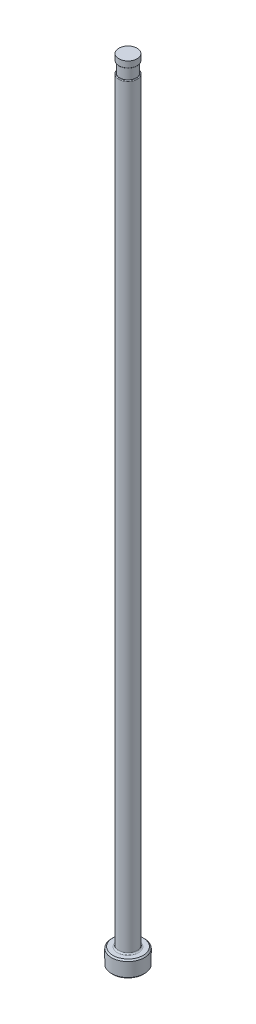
ISO-10303-21;
HEADER;
FILE_DESCRIPTION(('STEP AP214'),'2;1');
FILE_NAME('part.step','',(''),(''),'','','');
FILE_SCHEMA(('AUTOMOTIVE_DESIGN { 1 0 10303 214 1 1 1 1 }'));
ENDSEC;
DATA;
#1=APPLICATION_CONTEXT('core data for automotive mechanical design processes');
#2=APPLICATION_PROTOCOL_DEFINITION('international standard','automotive_design',2000,#1);
#3=PRODUCT_CONTEXT('',#1,'mechanical');
#4=PRODUCT('Part','Part','',(#3));
#5=PRODUCT_RELATED_PRODUCT_CATEGORY('part','',(#4));
#6=PRODUCT_DEFINITION_FORMATION('','',#4);
#7=PRODUCT_DEFINITION_CONTEXT('part definition',#1,'design');
#8=PRODUCT_DEFINITION('design','',#6,#7);
#9=PRODUCT_DEFINITION_SHAPE('','',#8);
#10=(LENGTH_UNIT() NAMED_UNIT(*) SI_UNIT(.MILLI.,.METRE.));
#11=(NAMED_UNIT(*) PLANE_ANGLE_UNIT() SI_UNIT($,.RADIAN.));
#12=(NAMED_UNIT(*) SI_UNIT($,.STERADIAN.) SOLID_ANGLE_UNIT());
#13=UNCERTAINTY_MEASURE_WITH_UNIT(LENGTH_MEASURE(1.E-05),#10,'distance_accuracy_value','');
#14=(GEOMETRIC_REPRESENTATION_CONTEXT(3) GLOBAL_UNCERTAINTY_ASSIGNED_CONTEXT((#13)) GLOBAL_UNIT_ASSIGNED_CONTEXT((#10,
#11,#12)) REPRESENTATION_CONTEXT('',''));
#15=CARTESIAN_POINT('',(0.,0.,0.));
#16=DIRECTION('',(0.,0.,1.));
#17=DIRECTION('',(1.,0.,0.));
#18=AXIS2_PLACEMENT_3D('',#15,#16,#17);
#19=CARTESIAN_POINT('',(-1.78561999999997,151.13,0.));
#20=DIRECTION('',(0.,1.,0.));
#21=DIRECTION('',(0.,0.,1.));
#22=AXIS2_PLACEMENT_3D('',#19,#20,#21);
#23=PLANE('',#22);
#24=CARTESIAN_POINT('',(0.,151.13,0.));
#25=DIRECTION('',(0.,1.,0.));
#26=DIRECTION('',(0.,0.,1.));
#27=AXIS2_PLACEMENT_3D('',#24,#25,#26);
#28=CIRCLE('',#27,1.63956999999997);
#29=CARTESIAN_POINT('',(0.,151.13,1.63956999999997));
#30=VERTEX_POINT('',#29);
#31=EDGE_CURVE('E11',#30,#30,#28,.F.);
#32=ORIENTED_EDGE('',*,*,#31,.T.);
#33=EDGE_LOOP('',(#32));
#34=FACE_BOUND('',#33,.T.);
#35=CARTESIAN_POINT('',(0.,151.13,0.));
#36=DIRECTION('',(0.,1.,0.));
#37=DIRECTION('',(0.,0.,1.));
#38=AXIS2_PLACEMENT_3D('',#35,#36,#37);
#39=CIRCLE('',#38,1.58241999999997);
#40=CARTESIAN_POINT('',(0.,151.13,1.58241999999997));
#41=VERTEX_POINT('',#40);
#42=EDGE_CURVE('E78',#41,#41,#39,.T.);
#43=ORIENTED_EDGE('',*,*,#42,.T.);
#44=EDGE_LOOP('',(#43));
#45=FACE_BOUND('',#44,.T.);
#46=ADVANCED_FACE('F36',(#34,#45),#23,.F.);
#47=CARTESIAN_POINT('',(0.,259.958771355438,0.));
#48=DIRECTION('',(0.,1.,0.));
#49=DIRECTION('',(0.,0.,1.));
#50=AXIS2_PLACEMENT_3D('',#47,#48,#49);
#51=CYLINDRICAL_SURFACE('',#50,1.78561999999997);
#52=DIRECTION('',(0.,1.,0.));
#53=VECTOR('',#52,1.);
#54=CARTESIAN_POINT('',(-1.58241999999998,259.958771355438,-0.827276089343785));
#55=LINE('',#54,#53);
#56=CARTESIAN_POINT('',(-1.58241999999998,148.971,-0.827276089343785));
#57=VERTEX_POINT('',#56);
#58=CARTESIAN_POINT('',(-1.58241999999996,86.614,-0.827276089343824));
#59=VERTEX_POINT('',#58);
#60=EDGE_CURVE('E73',#57,#59,#55,.F.);
#61=ORIENTED_EDGE('',*,*,#60,.F.);
#62=CARTESIAN_POINT('',(0.,148.971,0.));
#63=DIRECTION('',(0.,-1.,0.));
#64=DIRECTION('',(0.,0.,-1.));
#65=AXIS2_PLACEMENT_3D('',#62,#63,#64);
#66=CIRCLE('',#65,1.78561999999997);
#67=CARTESIAN_POINT('',(-1.58241999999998,148.971,0.827276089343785));
#68=VERTEX_POINT('',#67);
#69=EDGE_CURVE('E51',#57,#68,#66,.T.);
#70=ORIENTED_EDGE('',*,*,#69,.T.);
#71=DIRECTION('',(0.,1.,0.));
#72=VECTOR('',#71,1.);
#73=CARTESIAN_POINT('',(-1.58241999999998,259.958771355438,0.827276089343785));
#74=LINE('',#73,#72);
#75=CARTESIAN_POINT('',(-1.58241999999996,86.614,0.827276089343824));
#76=VERTEX_POINT('',#75);
#77=EDGE_CURVE('E84',#76,#68,#74,.T.);
#78=ORIENTED_EDGE('',*,*,#77,.F.);
#79=CARTESIAN_POINT('',(-1.58241999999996,86.614,-0.827276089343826));
#80=CARTESIAN_POINT('',(-1.58241859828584,86.57930589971,-0.827270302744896));
#81=CARTESIAN_POINT('',(-1.58298930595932,86.5446242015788,-0.826188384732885));
#82=CARTESIAN_POINT('',(-1.58525672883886,86.4754213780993,-0.821832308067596));
#83=CARTESIAN_POINT('',(-1.58695392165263,86.4409003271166,-0.81855721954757));
#84=CARTESIAN_POINT('',(-1.59374670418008,86.3372224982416,-0.805306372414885));
#85=CARTESIAN_POINT('',(-1.60054304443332,86.2685662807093,-0.791903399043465));
#86=CARTESIAN_POINT('',(-1.6181445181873,86.1342279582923,-0.755289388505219));
#87=CARTESIAN_POINT('',(-1.62896089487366,86.0685547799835,-0.732050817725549));
#88=CARTESIAN_POINT('',(-1.65351348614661,85.9428437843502,-0.674760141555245));
#89=CARTESIAN_POINT('',(-1.66723753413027,85.8827839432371,-0.640752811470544));
#90=CARTESIAN_POINT('',(-1.69108481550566,85.7895410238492,-0.574000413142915));
#91=CARTESIAN_POINT('',(-1.70092185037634,85.7539825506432,-0.544463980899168));
#92=CARTESIAN_POINT('',(-1.72024188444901,85.6880696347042,-0.479935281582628));
#93=CARTESIAN_POINT('',(-1.72972525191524,85.6577096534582,-0.444948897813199));
#94=CARTESIAN_POINT('',(-1.74591517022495,85.6079989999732,-0.375854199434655));
#95=CARTESIAN_POINT('',(-1.75282315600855,85.5876636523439,-0.34250427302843));
#96=CARTESIAN_POINT('',(-1.76503091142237,85.552596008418,-0.272685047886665));
#97=CARTESIAN_POINT('',(-1.7703313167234,85.5378614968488,-0.236216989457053));
#98=CARTESIAN_POINT('',(-1.77876737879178,85.5147234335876,-0.160839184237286));
#99=CARTESIAN_POINT('',(-1.78189089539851,85.5063553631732,-0.121917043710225));
#100=CARTESIAN_POINT('',(-1.78553515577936,85.4966126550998,-0.0430875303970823));
#101=CARTESIAN_POINT('',(-1.78605699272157,85.4952350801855,-0.00318057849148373));
#102=CARTESIAN_POINT('',(-1.78451570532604,85.499340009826,0.0723170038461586));
#103=CARTESIAN_POINT('',(-1.78269870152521,85.5041692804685,0.107950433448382));
#104=CARTESIAN_POINT('',(-1.77708661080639,85.5193299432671,0.177853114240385));
#105=CARTESIAN_POINT('',(-1.7732916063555,85.5296611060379,0.212122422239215));
#106=CARTESIAN_POINT('',(-1.76403207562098,85.5554906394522,0.278893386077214));
#107=CARTESIAN_POINT('',(-1.75854739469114,85.5710516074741,0.31136779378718));
#108=CARTESIAN_POINT('',(-1.74640529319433,85.6066424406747,0.373513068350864));
#109=CARTESIAN_POINT('',(-1.73974732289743,85.6266744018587,0.403182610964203));
#110=CARTESIAN_POINT('',(-1.72309018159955,85.6788692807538,0.470106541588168));
#111=CARTESIAN_POINT('',(-1.7127837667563,85.7127475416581,0.50595017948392));
#112=CARTESIAN_POINT('',(-1.69205421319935,85.7859822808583,0.57146965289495));
#113=CARTESIAN_POINT('',(-1.68163090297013,85.8253481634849,0.601134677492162));
#114=CARTESIAN_POINT('',(-1.65852628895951,85.9207765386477,0.662663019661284));
#115=CARTESIAN_POINT('',(-1.64612995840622,85.9782622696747,0.692421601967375));
#116=CARTESIAN_POINT('',(-1.62408795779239,86.0976981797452,0.742649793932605));
#117=CARTESIAN_POINT('',(-1.61444888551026,86.1596586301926,0.763097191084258));
#118=CARTESIAN_POINT('',(-1.5986900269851,86.2866358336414,0.795586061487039));
#119=CARTESIAN_POINT('',(-1.59259533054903,86.3516709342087,0.807567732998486));
#120=CARTESIAN_POINT('',(-1.58649588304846,86.4498700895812,0.819442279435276));
#121=CARTESIAN_POINT('',(-1.58496990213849,86.4826111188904,0.822384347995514));
#122=CARTESIAN_POINT('',(-1.58293155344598,86.5482312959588,0.826298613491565));
#123=CARTESIAN_POINT('',(-1.58241884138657,86.5811103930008,0.827271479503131));
#124=CARTESIAN_POINT('',(-1.58241999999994,86.6139999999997,0.827276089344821));
#125=B_SPLINE_CURVE_WITH_KNOTS('',3,(#79,#80,#81,#82,#83,#84,#85,#86,#87,#88,#89,#90,#91,#92,
#93,#94,#95,#96,#97,#98,#99,#100,#101,#102,#103,#104,#105,#106,#107,#108,#109,#110,#111,#112,
#113,#114,#115,#116,#117,#118,#119,#120,#121,#122,#123,#124),.UNSPECIFIED.,.F.,.F.,(4,2,2,2,2,2,
2,2,2,2,2,2,2,2,2,2,2,2,2,2,2,2,4),(0.,0.104035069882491,0.208114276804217,0.418101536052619,
0.628680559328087,0.838395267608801,0.979683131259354,1.12081951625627,1.23932997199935,
1.35779350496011,1.47691251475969,1.59598146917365,1.70348686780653,1.81098778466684,
1.91982417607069,2.02871169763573,2.1790397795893,2.32962872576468,2.5262950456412,
2.72342810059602,2.92194014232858,3.02060242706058,3.11923118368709),.UNSPECIFIED.);
#126=EDGE_CURVE('E81',#59,#76,#125,.T.);
#127=ORIENTED_EDGE('',*,*,#126,.F.);
#128=EDGE_LOOP('',(#61,#70,#78,#127));
#129=FACE_BOUND('',#128,.T.);
#130=CARTESIAN_POINT('',(0.,3.42900000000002,0.));
#131=DIRECTION('',(0.,1.,0.));
#132=DIRECTION('',(0.,0.,1.));
#133=AXIS2_PLACEMENT_3D('',#130,#131,#132);
#134=CIRCLE('',#133,1.78561999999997);
#135=CARTESIAN_POINT('',(0.,3.42900000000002,1.78561999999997));
#136=VERTEX_POINT('',#135);
#137=EDGE_CURVE('E116',#136,#136,#134,.T.);
#138=ORIENTED_EDGE('',*,*,#137,.T.);
#139=EDGE_LOOP('',(#138));
#140=FACE_BOUND('',#139,.T.);
#141=ADVANCED_FACE('F82',(#129,#140),#51,.T.);
#142=CARTESIAN_POINT('',(0.,0.,0.));
#143=DIRECTION('',(0.,-1.,0.));
#144=DIRECTION('',(0.,0.,-1.));
#145=AXIS2_PLACEMENT_3D('',#142,#143,#144);
#146=PLANE('',#145);
#147=CARTESIAN_POINT('',(0.,0.,0.));
#148=DIRECTION('',(0.,-1.,0.));
#149=DIRECTION('',(0.,0.,-1.));
#150=AXIS2_PLACEMENT_3D('',#147,#148,#149);
#151=CIRCLE('',#150,2.92099999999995);
#152=CARTESIAN_POINT('',(0.,0.,-2.92099999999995));
#153=VERTEX_POINT('',#152);
#154=EDGE_CURVE('E113',#153,#153,#151,.T.);
#155=ORIENTED_EDGE('',*,*,#154,.T.);
#156=EDGE_LOOP('',(#155));
#157=FACE_BOUND('',#156,.T.);
#158=ADVANCED_FACE('F192',(#157),#146,.T.);
#159=CARTESIAN_POINT('',(0.,259.958771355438,0.));
#160=DIRECTION('',(0.,1.,0.));
#161=DIRECTION('',(0.,0.,1.));
#162=AXIS2_PLACEMENT_3D('',#159,#160,#161);
#163=CYLINDRICAL_SURFACE('',#162,3.17499999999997);
#164=CARTESIAN_POINT('',(0.,2.92100000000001,0.));
#165=DIRECTION('',(0.,1.,0.));
#166=DIRECTION('',(0.,0.,1.));
#167=AXIS2_PLACEMENT_3D('',#164,#165,#166);
#168=CIRCLE('',#167,3.17499999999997);
#169=CARTESIAN_POINT('',(0.,2.92100000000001,3.17499999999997));
#170=VERTEX_POINT('',#169);
#171=EDGE_CURVE('E110',#170,#170,#168,.F.);
#172=ORIENTED_EDGE('',*,*,#171,.T.);
#173=EDGE_LOOP('',(#172));
#174=FACE_BOUND('',#173,.T.);
#175=CARTESIAN_POINT('',(0.,0.254000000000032,0.));
#176=DIRECTION('',(0.,-1.,0.));
#177=DIRECTION('',(0.,0.,-1.));
#178=AXIS2_PLACEMENT_3D('',#175,#176,#177);
#179=CIRCLE('',#178,3.17499999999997);
#180=CARTESIAN_POINT('',(0.,0.254000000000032,-3.17499999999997));
#181=VERTEX_POINT('',#180);
#182=EDGE_CURVE('E107',#181,#181,#179,.F.);
#183=ORIENTED_EDGE('',*,*,#182,.T.);
#184=EDGE_LOOP('',(#183));
#185=FACE_BOUND('',#184,.T.);
#186=ADVANCED_FACE('F195',(#174,#185),#163,.T.);
#187=CARTESIAN_POINT('',(-3.17499999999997,3.175,0.));
#188=DIRECTION('',(0.,1.,0.));
#189=DIRECTION('',(0.,0.,1.));
#190=AXIS2_PLACEMENT_3D('',#187,#188,#189);
#191=PLANE('',#190);
#192=CARTESIAN_POINT('',(0.,3.175,0.));
#193=DIRECTION('',(0.,1.,0.));
#194=DIRECTION('',(0.,0.,1.));
#195=AXIS2_PLACEMENT_3D('',#192,#193,#194);
#196=CIRCLE('',#195,2.03961999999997);
#197=CARTESIAN_POINT('',(0.,3.175,2.03961999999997));
#198=VERTEX_POINT('',#197);
#199=EDGE_CURVE('E87',#198,#198,#196,.F.);
#200=ORIENTED_EDGE('',*,*,#199,.T.);
#201=EDGE_LOOP('',(#200));
#202=FACE_BOUND('',#201,.T.);
#203=CARTESIAN_POINT('',(0.,3.175,0.));
#204=DIRECTION('',(0.,1.,0.));
#205=DIRECTION('',(0.,0.,1.));
#206=AXIS2_PLACEMENT_3D('',#203,#204,#205);
#207=CIRCLE('',#206,2.92099999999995);
#208=CARTESIAN_POINT('',(0.,3.175,2.92099999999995));
#209=VERTEX_POINT('',#208);
#210=EDGE_CURVE('E104',#209,#209,#207,.T.);
#211=ORIENTED_EDGE('',*,*,#210,.T.);
#212=EDGE_LOOP('',(#211));
#213=FACE_BOUND('',#212,.T.);
#214=ADVANCED_FACE('F190',(#202,#213),#191,.T.);
#215=CARTESIAN_POINT('',(0.,3.17499999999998,0.));
#216=DIRECTION('',(0.,-1.,0.));
#217=DIRECTION('',(0.,0.,-1.));
#218=AXIS2_PLACEMENT_3D('',#215,#216,#217);
#219=CONICAL_SURFACE('',#218,2.92099999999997,0.7853981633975);
#220=ORIENTED_EDGE('',*,*,#171,.F.);
#221=EDGE_LOOP('',(#220));
#222=FACE_BOUND('',#221,.T.);
#223=ORIENTED_EDGE('',*,*,#210,.F.);
#224=EDGE_LOOP('',(#223));
#225=FACE_BOUND('',#224,.T.);
#226=ADVANCED_FACE('F186',(#222,#225),#219,.T.);
#227=CARTESIAN_POINT('',(0.,0.254000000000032,0.));
#228=DIRECTION('',(0.,1.,0.));
#229=DIRECTION('',(0.,0.,1.));
#230=AXIS2_PLACEMENT_3D('',#227,#228,#229);
#231=CONICAL_SURFACE('',#230,3.17499999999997,0.785398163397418);
#232=ORIENTED_EDGE('',*,*,#154,.F.);
#233=EDGE_LOOP('',(#232));
#234=FACE_BOUND('',#233,.T.);
#235=ORIENTED_EDGE('',*,*,#182,.F.);
#236=EDGE_LOOP('',(#235));
#237=FACE_BOUND('',#236,.T.);
#238=ADVANCED_FACE('F182',(#234,#237),#231,.T.);
#239=CARTESIAN_POINT('',(0.,3.42900000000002,0.));
#240=DIRECTION('',(0.,1.,0.));
#241=DIRECTION('',(0.,0.,1.));
#242=AXIS2_PLACEMENT_3D('',#239,#240,#241);
#243=TOROIDAL_SURFACE('',#242,2.03961999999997,0.254);
#244=ORIENTED_EDGE('',*,*,#199,.F.);
#245=EDGE_LOOP('',(#244));
#246=FACE_BOUND('',#245,.T.);
#247=ORIENTED_EDGE('',*,*,#137,.F.);
#248=EDGE_LOOP('',(#247));
#249=FACE_BOUND('',#248,.T.);
#250=ADVANCED_FACE('F147',(#246,#249),#243,.F.);
#251=CARTESIAN_POINT('',(-1.78561999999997,149.098,0.));
#252=DIRECTION('',(0.,-1.,0.));
#253=DIRECTION('',(0.,0.,-1.));
#254=AXIS2_PLACEMENT_3D('',#251,#252,#253);
#255=PLANE('',#254);
#256=DIRECTION('',(0.,0.,1.));
#257=VECTOR('',#256,1.);
#258=CARTESIAN_POINT('',(-1.58241999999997,149.098,0.));
#259=LINE('',#258,#257);
#260=CARTESIAN_POINT('',(-1.58241999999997,149.098,0.));
#261=VERTEX_POINT('',#260);
#262=CARTESIAN_POINT('',(-1.58241999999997,149.098,0.496957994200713));
#263=VERTEX_POINT('',#262);
#264=EDGE_CURVE('E90',#261,#263,#259,.T.);
#265=ORIENTED_EDGE('',*,*,#264,.T.);
#266=CARTESIAN_POINT('',(0.,149.098,0.));
#267=DIRECTION('',(0.,-1.,0.));
#268=DIRECTION('',(0.,0.,-1.));
#269=AXIS2_PLACEMENT_3D('',#266,#267,#268);
#270=CIRCLE('',#269,1.65861999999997);
#271=CARTESIAN_POINT('',(-1.58241999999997,149.098,-0.496957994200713));
#272=VERTEX_POINT('',#271);
#273=EDGE_CURVE('E86',#263,#272,#270,.F.);
#274=ORIENTED_EDGE('',*,*,#273,.T.);
#275=EDGE_CURVE('E79',#272,#261,#259,.T.);
#276=ORIENTED_EDGE('',*,*,#275,.T.);
#277=CARTESIAN_POINT('',(0.,149.098,0.));
#278=DIRECTION('',(0.,1.,0.));
#279=DIRECTION('',(0.,0.,1.));
#280=AXIS2_PLACEMENT_3D('',#277,#278,#279);
#281=CIRCLE('',#280,1.58241999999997);
#282=EDGE_CURVE('E101',#261,#261,#281,.T.);
#283=ORIENTED_EDGE('',*,*,#282,.F.);
#284=EDGE_LOOP('',(#265,#274,#276,#283));
#285=FACE_BOUND('',#284,.T.);
#286=ADVANCED_FACE('F144',(#285),#255,.F.);
#287=CARTESIAN_POINT('',(0.,153.448281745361,0.));
#288=DIRECTION('',(0.,1.,0.));
#289=DIRECTION('',(0.,0.,1.));
#290=AXIS2_PLACEMENT_3D('',#287,#288,#289);
#291=CYLINDRICAL_SURFACE('',#290,1.58241999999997);
#292=ORIENTED_EDGE('',*,*,#42,.F.);
#293=EDGE_LOOP('',(#292));
#294=FACE_BOUND('',#293,.T.);
#295=ORIENTED_EDGE('',*,*,#282,.T.);
#296=EDGE_LOOP('',(#295));
#297=FACE_BOUND('',#296,.T.);
#298=ADVANCED_FACE('F141',(#294,#297),#291,.T.);
#299=CARTESIAN_POINT('',(-1.58241999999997,150.114,-3.17499999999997));
#300=DIRECTION('',(1.,0.,0.));
#301=DIRECTION('',(0.,1.,0.));
#302=AXIS2_PLACEMENT_3D('',#299,#300,#301);
#303=PLANE('',#302);
#304=ORIENTED_EDGE('',*,*,#275,.F.);
#305=CARTESIAN_POINT('',(-1.58241999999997,149.098,-0.496957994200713));
#306=CARTESIAN_POINT('',(-1.58241999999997,149.097990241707,-0.513789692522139));
#307=CARTESIAN_POINT('',(-1.58241999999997,149.09769820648,-0.530633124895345));
#308=CARTESIAN_POINT('',(-1.58241999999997,149.096318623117,-0.56437499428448));
#309=CARTESIAN_POINT('',(-1.58241999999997,149.095226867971,-0.58127324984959));
#310=CARTESIAN_POINT('',(-1.58241999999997,149.092012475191,-0.614973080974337));
#311=CARTESIAN_POINT('',(-1.58241999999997,149.089890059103,-0.631774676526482));
#312=CARTESIAN_POINT('',(-1.58241999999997,149.084280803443,-0.665126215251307));
#313=CARTESIAN_POINT('',(-1.58241999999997,149.080797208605,-0.681676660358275));
#314=CARTESIAN_POINT('',(-1.58241999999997,149.074084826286,-0.706389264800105));
#315=CARTESIAN_POINT('',(-1.58241999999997,149.071547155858,-0.714738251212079));
#316=CARTESIAN_POINT('',(-1.58241999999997,149.06584368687,-0.73126480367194));
#317=CARTESIAN_POINT('',(-1.58241999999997,149.062675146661,-0.739441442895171));
#318=CARTESIAN_POINT('',(-1.58241999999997,149.054581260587,-0.75771242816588));
#319=CARTESIAN_POINT('',(-1.58241999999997,149.049412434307,-0.76770109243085));
#320=CARTESIAN_POINT('',(-1.58241999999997,149.037398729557,-0.786606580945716));
#321=CARTESIAN_POINT('',(-1.58241999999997,149.030567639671,-0.795531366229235));
#322=CARTESIAN_POINT('',(-1.58241999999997,149.019582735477,-0.80632073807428));
#323=CARTESIAN_POINT('',(-1.58241999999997,149.016377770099,-0.809143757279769));
#324=CARTESIAN_POINT('',(-1.58241999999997,149.009610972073,-0.814338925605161));
#325=CARTESIAN_POINT('',(-1.58241999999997,149.006048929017,-0.816710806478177));
#326=CARTESIAN_POINT('',(-1.58241999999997,148.998529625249,-0.820873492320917));
#327=CARTESIAN_POINT('',(-1.58241999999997,148.994567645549,-0.822655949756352));
#328=CARTESIAN_POINT('',(-1.58241999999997,148.98637382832,-0.825404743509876));
#329=CARTESIAN_POINT('',(-1.58241999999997,148.982143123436,-0.826374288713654));
#330=CARTESIAN_POINT('',(-1.58241999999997,148.976726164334,-0.827008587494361));
#331=CARTESIAN_POINT('',(-1.58241999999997,148.975583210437,-0.827108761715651));
#332=CARTESIAN_POINT('',(-1.58241999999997,148.973293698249,-0.827242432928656));
#333=CARTESIAN_POINT('',(-1.58241999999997,148.972147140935,-0.827275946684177));
#334=CARTESIAN_POINT('',(-1.58241999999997,148.971,-0.827276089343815));
#335=B_SPLINE_CURVE_WITH_KNOTS('',3,(#305,#306,#307,#308,#309,#310,#311,#312,#313,#314,#315,
#316,#317,#318,#319,#320,#321,#322,#323,#324,#325,#326,#327,#328,#329,#330,#331,#332,#333,#334),
.UNSPECIFIED.,.F.,.F.,(4,2,2,2,2,2,2,2,2,2,2,2,2,2,4),(0.,0.0505111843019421,0.101290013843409,
0.152057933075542,0.202705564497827,0.228865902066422,0.255142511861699,0.288792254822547,
0.322171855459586,0.33495504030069,0.347745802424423,0.360710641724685,0.373624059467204,
0.377064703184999,0.380504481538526),.UNSPECIFIED.);
#336=EDGE_CURVE('E59',#272,#57,#335,.T.);
#337=ORIENTED_EDGE('',*,*,#336,.T.);
#338=ORIENTED_EDGE('',*,*,#60,.T.);
#339=DIRECTION('',(0.,0.,1.));
#340=VECTOR('',#339,1.);
#341=CARTESIAN_POINT('',(-1.58241999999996,86.614,-3.17499999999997));
#342=LINE('',#341,#340);
#343=EDGE_CURVE('E77',#59,#76,#342,.T.);
#344=ORIENTED_EDGE('',*,*,#343,.T.);
#345=ORIENTED_EDGE('',*,*,#77,.T.);
#346=CARTESIAN_POINT('',(-1.58241999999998,148.971,0.827276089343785));
#347=CARTESIAN_POINT('',(-1.58241999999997,148.974578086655,0.827284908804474));
#348=CARTESIAN_POINT('',(-1.58241999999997,148.978145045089,0.82695017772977));
#349=CARTESIAN_POINT('',(-1.58241999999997,148.985132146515,0.825674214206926));
#350=CARTESIAN_POINT('',(-1.58241999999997,148.988553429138,0.824739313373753));
#351=CARTESIAN_POINT('',(-1.58241999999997,148.995944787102,0.822072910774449));
#352=CARTESIAN_POINT('',(-1.58241999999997,148.999866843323,0.8202101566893));
#353=CARTESIAN_POINT('',(-1.58241999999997,149.007366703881,0.815871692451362));
#354=CARTESIAN_POINT('',(-1.58241999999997,149.010942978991,0.813393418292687));
#355=CARTESIAN_POINT('',(-1.58241999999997,149.019559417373,0.806534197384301));
#356=CARTESIAN_POINT('',(-1.58241999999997,149.024353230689,0.801846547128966));
#357=CARTESIAN_POINT('',(-1.58241999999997,149.033183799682,0.791817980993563));
#358=CARTESIAN_POINT('',(-1.58241999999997,149.037219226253,0.786475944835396));
#359=CARTESIAN_POINT('',(-1.58241999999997,149.047959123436,0.770471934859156));
#360=CARTESIAN_POINT('',(-1.58241999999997,149.053868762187,0.759282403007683));
#361=CARTESIAN_POINT('',(-1.58241999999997,149.064145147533,0.7361604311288));
#362=CARTESIAN_POINT('',(-1.58241999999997,149.068499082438,0.724222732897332));
#363=CARTESIAN_POINT('',(-1.58241999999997,149.077780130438,0.694353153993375));
#364=CARTESIAN_POINT('',(-1.58241999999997,149.082032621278,0.676214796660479));
#365=CARTESIAN_POINT('',(-1.58241999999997,149.088803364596,0.639581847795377));
#366=CARTESIAN_POINT('',(-1.58241999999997,149.091315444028,0.62108622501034));
#367=CARTESIAN_POINT('',(-1.58241999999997,149.094962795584,0.584931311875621));
#368=CARTESIAN_POINT('',(-1.58241999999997,149.096162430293,0.567278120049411));
#369=CARTESIAN_POINT('',(-1.58241999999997,149.097671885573,0.532064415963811));
#370=CARTESIAN_POINT('',(-1.58241999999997,149.097988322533,0.51450420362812));
#371=CARTESIAN_POINT('',(-1.58241999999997,149.098,0.496957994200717));
#372=B_SPLINE_CURVE_WITH_KNOTS('',3,(#346,#347,#348,#349,#350,#351,#352,#353,#354,#355,#356,
#357,#358,#359,#360,#361,#362,#363,#364,#365,#366,#367,#368,#369,#370,#371),.UNSPECIFIED.,.F.,
.F.,(4,2,2,2,2,2,2,2,2,2,2,2,4),(0.,0.0107006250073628,0.0212901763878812,0.0342440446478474,
0.0472528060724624,0.0672536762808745,0.0872892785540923,0.125039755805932,0.163094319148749,
0.218841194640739,0.274784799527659,0.327841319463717,0.380499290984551),.UNSPECIFIED.);
#373=EDGE_CURVE('E172',#68,#263,#372,.T.);
#374=ORIENTED_EDGE('',*,*,#373,.T.);
#375=ORIENTED_EDGE('',*,*,#264,.F.);
#376=EDGE_LOOP('',(#304,#337,#338,#344,#345,#374,#375));
#377=FACE_BOUND('',#376,.T.);
#378=ADVANCED_FACE('F75',(#377),#303,.F.);
#379=CARTESIAN_POINT('',(-4.75741999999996,86.614,-3.17499999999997));
#380=DIRECTION('',(0.,0.,1.));
#381=DIRECTION('',(1.,0.,0.));
#382=AXIS2_PLACEMENT_3D('',#379,#380,#381);
#383=CYLINDRICAL_SURFACE('',#382,3.175);
#384=ORIENTED_EDGE('',*,*,#343,.F.);
#385=ORIENTED_EDGE('',*,*,#126,.T.);
#386=EDGE_LOOP('',(#384,#385));
#387=FACE_BOUND('',#386,.T.);
#388=ADVANCED_FACE('F89',(#387),#383,.F.);
#389=CARTESIAN_POINT('',(0.,152.687735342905,0.));
#390=DIRECTION('',(0.,1.,0.));
#391=DIRECTION('',(0.,0.,1.));
#392=AXIS2_PLACEMENT_3D('',#389,#390,#391);
#393=CYLINDRICAL_SURFACE('',#392,1.76656999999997);
#394=CARTESIAN_POINT('',(0.,151.257,0.));
#395=DIRECTION('',(0.,1.,0.));
#396=DIRECTION('',(0.,0.,1.));
#397=AXIS2_PLACEMENT_3D('',#394,#395,#396);
#398=CIRCLE('',#397,1.76656999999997);
#399=CARTESIAN_POINT('',(0.,151.257,1.76656999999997));
#400=VERTEX_POINT('',#399);
#401=EDGE_CURVE('E44',#400,#400,#398,.T.);
#402=ORIENTED_EDGE('',*,*,#401,.T.);
#403=EDGE_LOOP('',(#402));
#404=FACE_BOUND('',#403,.T.);
#405=CARTESIAN_POINT('',(0.,152.4,0.));
#406=DIRECTION('',(0.,1.,0.));
#407=DIRECTION('',(0.,0.,1.));
#408=AXIS2_PLACEMENT_3D('',#405,#406,#407);
#409=CIRCLE('',#408,1.76656999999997);
#410=CARTESIAN_POINT('',(0.,152.4,1.76656999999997));
#411=VERTEX_POINT('',#410);
#412=EDGE_CURVE('E91',#411,#411,#409,.T.);
#413=ORIENTED_EDGE('',*,*,#412,.F.);
#414=EDGE_LOOP('',(#413));
#415=FACE_BOUND('',#414,.T.);
#416=ADVANCED_FACE('F135',(#404,#415),#393,.T.);
#417=CARTESIAN_POINT('',(-1.78561999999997,152.4,0.));
#418=DIRECTION('',(0.,1.,0.));
#419=DIRECTION('',(0.,0.,1.));
#420=AXIS2_PLACEMENT_3D('',#417,#418,#419);
#421=PLANE('',#420);
#422=ORIENTED_EDGE('',*,*,#412,.T.);
#423=EDGE_LOOP('',(#422));
#424=FACE_BOUND('',#423,.T.);
#425=ADVANCED_FACE('F149',(#424),#421,.T.);
#426=CARTESIAN_POINT('',(0.,148.971,0.));
#427=DIRECTION('',(0.,-1.,0.));
#428=DIRECTION('',(0.,0.,-1.));
#429=AXIS2_PLACEMENT_3D('',#426,#427,#428);
#430=TOROIDAL_SURFACE('',#429,1.65861999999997,0.127);
#431=ORIENTED_EDGE('',*,*,#373,.F.);
#432=ORIENTED_EDGE('',*,*,#69,.F.);
#433=ORIENTED_EDGE('',*,*,#336,.F.);
#434=ORIENTED_EDGE('',*,*,#273,.F.);
#435=EDGE_LOOP('',(#431,#432,#433,#434));
#436=FACE_BOUND('',#435,.T.);
#437=ADVANCED_FACE('F151',(#436),#430,.T.);
#438=CARTESIAN_POINT('',(0.,151.257,0.));
#439=DIRECTION('',(0.,1.,0.));
#440=DIRECTION('',(0.,0.,1.));
#441=AXIS2_PLACEMENT_3D('',#438,#439,#440);
#442=TOROIDAL_SURFACE('',#441,1.63956999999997,0.127);
#443=ORIENTED_EDGE('',*,*,#31,.F.);
#444=EDGE_LOOP('',(#443));
#445=FACE_BOUND('',#444,.T.);
#446=ORIENTED_EDGE('',*,*,#401,.F.);
#447=EDGE_LOOP('',(#446));
#448=FACE_BOUND('',#447,.T.);
#449=ADVANCED_FACE('F38',(#445,#448),#442,.T.);
#450=CLOSED_SHELL('',(#46,#141,#158,#186,#214,#226,#238,#250,#286,#298,#378,#388,#416,#425,#437,#449));
#451=MANIFOLD_SOLID_BREP('B2',#450);
#452=ADVANCED_BREP_SHAPE_REPRESENTATION('',(#18,#451),#14);
#453=SHAPE_DEFINITION_REPRESENTATION(#9,#452);
ENDSEC;
END-ISO-10303-21;
